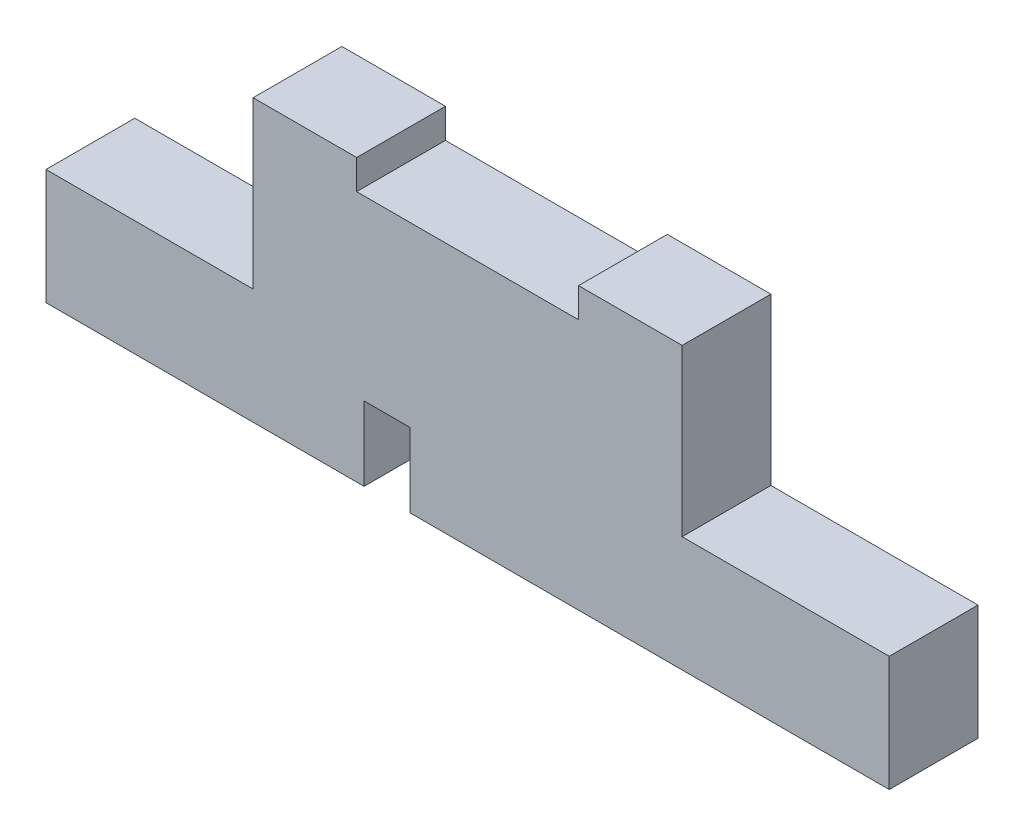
from build123d import *

# Parameters (mm, degrees)
BOSS_EXTRU_1_DEPTH      = 6
ESQUISSE2_W             = 15
ESQUISSE2_H             = 4
ENL_V_MAT_EXTRU_1_DEPTH = 41.709335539


with BuildPart() as part:
    # Esquisse1 → Boss.-Extru.1 (new body)
    with BuildSketch(Plane.XY):
        Polygon((-21.5, 0), (0, 0), (0, 5), (3.1, 5), (3.1, 0), (35.5, 0), (35.5, 7.8), (21.5, 7.8), (21.5, 19), (-7.5, 19), (-7.5, 7.8), (-21.5, 7.8), align=None)
    extrude(amount=BOSS_EXTRU_1_DEPTH)

    # Esquisse2 → Enl_v. mat.-Extru.1 (cut, through all)
    with BuildSketch(Plane.XY.offset(6)):
        with Locations((7, 19)):
            Rectangle(ESQUISSE2_W, ESQUISSE2_H)
    extrude(amount=-ENL_V_MAT_EXTRU_1_DEPTH, mode=Mode.SUBTRACT)


solid = part.part
